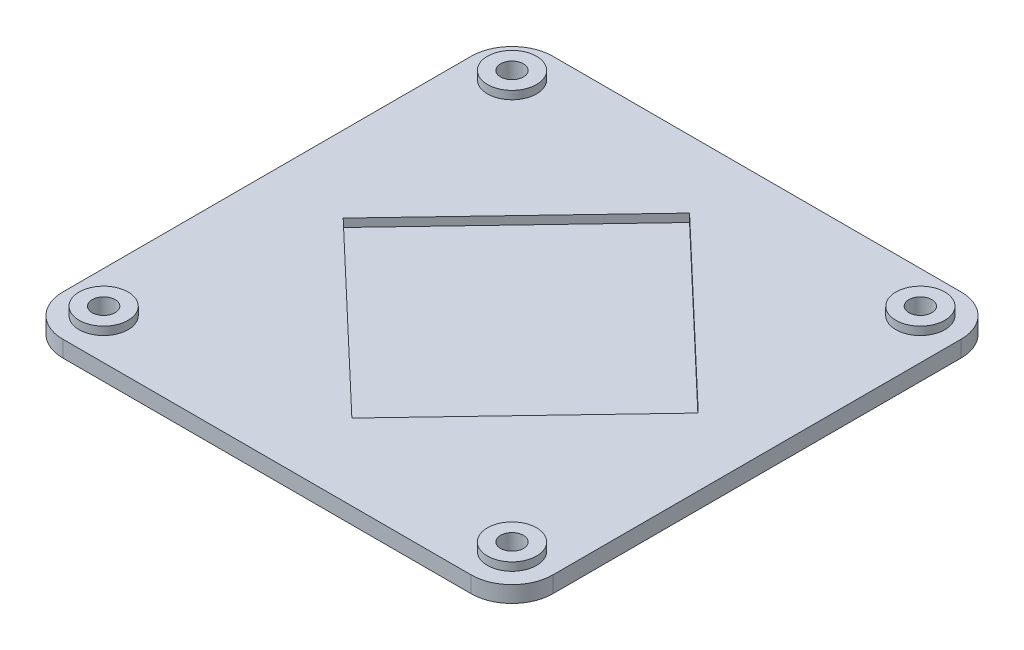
ISO-10303-21;
HEADER;
FILE_DESCRIPTION(('STEP AP214'),'2;1');
FILE_NAME('part.step','',(''),(''),'','','');
FILE_SCHEMA(('AUTOMOTIVE_DESIGN { 1 0 10303 214 1 1 1 1 }'));
ENDSEC;
DATA;
#1=APPLICATION_CONTEXT('core data for automotive mechanical design processes');
#2=APPLICATION_PROTOCOL_DEFINITION('international standard','automotive_design',2000,#1);
#3=PRODUCT_CONTEXT('',#1,'mechanical');
#4=PRODUCT('Part','Part','',(#3));
#5=PRODUCT_RELATED_PRODUCT_CATEGORY('part','',(#4));
#6=PRODUCT_DEFINITION_FORMATION('','',#4);
#7=PRODUCT_DEFINITION_CONTEXT('part definition',#1,'design');
#8=PRODUCT_DEFINITION('design','',#6,#7);
#9=PRODUCT_DEFINITION_SHAPE('','',#8);
#10=(LENGTH_UNIT() NAMED_UNIT(*) SI_UNIT(.MILLI.,.METRE.));
#11=(NAMED_UNIT(*) PLANE_ANGLE_UNIT() SI_UNIT($,.RADIAN.));
#12=(NAMED_UNIT(*) SI_UNIT($,.STERADIAN.) SOLID_ANGLE_UNIT());
#13=UNCERTAINTY_MEASURE_WITH_UNIT(LENGTH_MEASURE(1.E-05),#10,'distance_accuracy_value','');
#14=(GEOMETRIC_REPRESENTATION_CONTEXT(3) GLOBAL_UNCERTAINTY_ASSIGNED_CONTEXT((#13)) GLOBAL_UNIT_ASSIGNED_CONTEXT((#10,
#11,#12)) REPRESENTATION_CONTEXT('',''));
#15=CARTESIAN_POINT('',(0.,0.,0.));
#16=DIRECTION('',(0.,0.,1.));
#17=DIRECTION('',(1.,0.,0.));
#18=AXIS2_PLACEMENT_3D('',#15,#16,#17);
#19=CARTESIAN_POINT('',(30.,2.,-30.));
#20=DIRECTION('',(-1.,0.,0.));
#21=DIRECTION('',(0.,0.,1.));
#22=AXIS2_PLACEMENT_3D('',#19,#20,#21);
#23=PLANE('',#22);
#24=DIRECTION('',(0.,0.,-1.));
#25=VECTOR('',#24,1.);
#26=CARTESIAN_POINT('',(30.,0.,-30.));
#27=LINE('',#26,#25);
#28=CARTESIAN_POINT('',(30.,0.,25.));
#29=VERTEX_POINT('',#28);
#30=CARTESIAN_POINT('',(30.,0.,-25.));
#31=VERTEX_POINT('',#30);
#32=EDGE_CURVE('E212',#29,#31,#27,.T.);
#33=ORIENTED_EDGE('',*,*,#32,.T.);
#34=DIRECTION('',(0.,-1.,0.));
#35=VECTOR('',#34,1.);
#36=CARTESIAN_POINT('',(30.,2.,-25.));
#37=LINE('',#36,#35);
#38=CARTESIAN_POINT('',(30.,2.,-25.));
#39=VERTEX_POINT('',#38);
#40=EDGE_CURVE('E252',#31,#39,#37,.F.);
#41=ORIENTED_EDGE('',*,*,#40,.T.);
#42=DIRECTION('',(0.,0.,-1.));
#43=VECTOR('',#42,1.);
#44=CARTESIAN_POINT('',(30.,2.,-30.));
#45=LINE('',#44,#43);
#46=CARTESIAN_POINT('',(30.,2.,25.));
#47=VERTEX_POINT('',#46);
#48=EDGE_CURVE('E215',#47,#39,#45,.T.);
#49=ORIENTED_EDGE('',*,*,#48,.F.);
#50=DIRECTION('',(0.,-1.,0.));
#51=VECTOR('',#50,1.);
#52=CARTESIAN_POINT('',(30.,2.,25.));
#53=LINE('',#52,#51);
#54=EDGE_CURVE('E249',#47,#29,#53,.T.);
#55=ORIENTED_EDGE('',*,*,#54,.T.);
#56=EDGE_LOOP('',(#33,#41,#49,#55));
#57=FACE_BOUND('',#56,.T.);
#58=ADVANCED_FACE('F38',(#57),#23,.F.);
#59=CARTESIAN_POINT('',(-30.,2.,-30.));
#60=DIRECTION('',(0.,0.,1.));
#61=DIRECTION('',(1.,0.,0.));
#62=AXIS2_PLACEMENT_3D('',#59,#60,#61);
#63=PLANE('',#62);
#64=DIRECTION('',(-1.,0.,0.));
#65=VECTOR('',#64,1.);
#66=CARTESIAN_POINT('',(-30.,2.,-30.));
#67=LINE('',#66,#65);
#68=CARTESIAN_POINT('',(25.,2.,-30.));
#69=VERTEX_POINT('',#68);
#70=CARTESIAN_POINT('',(-25.,2.,-30.));
#71=VERTEX_POINT('',#70);
#72=EDGE_CURVE('E218',#69,#71,#67,.T.);
#73=ORIENTED_EDGE('',*,*,#72,.F.);
#74=DIRECTION('',(0.,-1.,0.));
#75=VECTOR('',#74,1.);
#76=CARTESIAN_POINT('',(25.,2.,-30.));
#77=LINE('',#76,#75);
#78=CARTESIAN_POINT('',(25.,0.,-30.));
#79=VERTEX_POINT('',#78);
#80=EDGE_CURVE('E238',#69,#79,#77,.T.);
#81=ORIENTED_EDGE('',*,*,#80,.T.);
#82=DIRECTION('',(-1.,0.,0.));
#83=VECTOR('',#82,1.);
#84=CARTESIAN_POINT('',(-30.,0.,-30.));
#85=LINE('',#84,#83);
#86=CARTESIAN_POINT('',(-25.,0.,-30.));
#87=VERTEX_POINT('',#86);
#88=EDGE_CURVE('E230',#79,#87,#85,.T.);
#89=ORIENTED_EDGE('',*,*,#88,.T.);
#90=DIRECTION('',(0.,-1.,0.));
#91=VECTOR('',#90,1.);
#92=CARTESIAN_POINT('',(-25.,2.,-30.));
#93=LINE('',#92,#91);
#94=EDGE_CURVE('E227',#87,#71,#93,.F.);
#95=ORIENTED_EDGE('',*,*,#94,.T.);
#96=EDGE_LOOP('',(#73,#81,#89,#95));
#97=FACE_BOUND('',#96,.T.);
#98=ADVANCED_FACE('F299',(#97),#63,.F.);
#99=CARTESIAN_POINT('',(-30.,2.,-30.));
#100=DIRECTION('',(1.,0.,0.));
#101=DIRECTION('',(0.,0.,-1.));
#102=AXIS2_PLACEMENT_3D('',#99,#100,#101);
#103=PLANE('',#102);
#104=DIRECTION('',(0.,0.,1.));
#105=VECTOR('',#104,1.);
#106=CARTESIAN_POINT('',(-30.,0.,-30.));
#107=LINE('',#106,#105);
#108=CARTESIAN_POINT('',(-30.,0.,-25.));
#109=VERTEX_POINT('',#108);
#110=CARTESIAN_POINT('',(-30.,0.,25.));
#111=VERTEX_POINT('',#110);
#112=EDGE_CURVE('E233',#109,#111,#107,.T.);
#113=ORIENTED_EDGE('',*,*,#112,.T.);
#114=DIRECTION('',(0.,-1.,0.));
#115=VECTOR('',#114,1.);
#116=CARTESIAN_POINT('',(-30.,2.,25.));
#117=LINE('',#116,#115);
#118=CARTESIAN_POINT('',(-30.,2.,25.));
#119=VERTEX_POINT('',#118);
#120=EDGE_CURVE('E11',#111,#119,#117,.F.);
#121=ORIENTED_EDGE('',*,*,#120,.T.);
#122=DIRECTION('',(0.,0.,1.));
#123=VECTOR('',#122,1.);
#124=CARTESIAN_POINT('',(-30.,2.,-30.));
#125=LINE('',#124,#123);
#126=CARTESIAN_POINT('',(-30.,2.,-25.));
#127=VERTEX_POINT('',#126);
#128=EDGE_CURVE('E222',#127,#119,#125,.T.);
#129=ORIENTED_EDGE('',*,*,#128,.F.);
#130=DIRECTION('',(0.,-1.,0.));
#131=VECTOR('',#130,1.);
#132=CARTESIAN_POINT('',(-30.,2.,-25.));
#133=LINE('',#132,#131);
#134=EDGE_CURVE('E46',#127,#109,#133,.T.);
#135=ORIENTED_EDGE('',*,*,#134,.T.);
#136=EDGE_LOOP('',(#113,#121,#129,#135));
#137=FACE_BOUND('',#136,.T.);
#138=ADVANCED_FACE('F270',(#137),#103,.F.);
#139=CARTESIAN_POINT('',(-30.,2.,30.));
#140=DIRECTION('',(0.,0.,-1.));
#141=DIRECTION('',(-1.,0.,0.));
#142=AXIS2_PLACEMENT_3D('',#139,#140,#141);
#143=PLANE('',#142);
#144=DIRECTION('',(1.,0.,0.));
#145=VECTOR('',#144,1.);
#146=CARTESIAN_POINT('',(-30.,0.,30.));
#147=LINE('',#146,#145);
#148=CARTESIAN_POINT('',(-25.,0.,30.));
#149=VERTEX_POINT('',#148);
#150=CARTESIAN_POINT('',(25.,0.,30.));
#151=VERTEX_POINT('',#150);
#152=EDGE_CURVE('E219',#149,#151,#147,.T.);
#153=ORIENTED_EDGE('',*,*,#152,.T.);
#154=DIRECTION('',(0.,-1.,0.));
#155=VECTOR('',#154,1.);
#156=CARTESIAN_POINT('',(25.,2.,30.));
#157=LINE('',#156,#155);
#158=CARTESIAN_POINT('',(25.,2.,30.));
#159=VERTEX_POINT('',#158);
#160=EDGE_CURVE('E61',#151,#159,#157,.F.);
#161=ORIENTED_EDGE('',*,*,#160,.T.);
#162=DIRECTION('',(1.,0.,0.));
#163=VECTOR('',#162,1.);
#164=CARTESIAN_POINT('',(-30.,2.,30.));
#165=LINE('',#164,#163);
#166=CARTESIAN_POINT('',(-25.,2.,30.));
#167=VERTEX_POINT('',#166);
#168=EDGE_CURVE('E225',#167,#159,#165,.T.);
#169=ORIENTED_EDGE('',*,*,#168,.F.);
#170=DIRECTION('',(0.,-1.,0.));
#171=VECTOR('',#170,1.);
#172=CARTESIAN_POINT('',(-25.,2.,30.));
#173=LINE('',#172,#171);
#174=EDGE_CURVE('E262',#167,#149,#173,.T.);
#175=ORIENTED_EDGE('',*,*,#174,.T.);
#176=EDGE_LOOP('',(#153,#161,#169,#175));
#177=FACE_BOUND('',#176,.T.);
#178=ADVANCED_FACE('F282',(#177),#143,.F.);
#179=CARTESIAN_POINT('',(0.,2.,0.));
#180=DIRECTION('',(0.,1.,0.));
#181=DIRECTION('',(0.,0.,1.));
#182=AXIS2_PLACEMENT_3D('',#179,#180,#181);
#183=PLANE('',#182);
#184=DIRECTION('',(-0.689120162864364,0.,0.724647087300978));
#185=VECTOR('',#184,1.);
#186=CARTESIAN_POINT('',(-20.6736048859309,2.,0.));
#187=LINE('',#186,#185);
#188=CARTESIAN_POINT('',(0.,2.,-21.7394126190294));
#189=VERTEX_POINT('',#188);
#190=CARTESIAN_POINT('',(-20.6736048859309,2.,0.));
#191=VERTEX_POINT('',#190);
#192=EDGE_CURVE('E53',#189,#191,#187,.T.);
#193=ORIENTED_EDGE('',*,*,#192,.F.);
#194=DIRECTION('',(-0.724647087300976,0.,-0.689120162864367));
#195=VECTOR('',#194,1.);
#196=CARTESIAN_POINT('',(0.,2.,-21.7394126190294));
#197=LINE('',#196,#195);
#198=CARTESIAN_POINT('',(21.7394126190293,2.,-1.06580773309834));
#199=VERTEX_POINT('',#198);
#200=EDGE_CURVE('E148',#199,#189,#197,.T.);
#201=ORIENTED_EDGE('',*,*,#200,.F.);
#202=DIRECTION('',(0.689120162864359,0.,-0.724647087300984));
#203=VECTOR('',#202,1.);
#204=CARTESIAN_POINT('',(21.7394126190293,2.,-1.06580773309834));
#205=LINE('',#204,#203);
#206=CARTESIAN_POINT('',(1.06580773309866,2.,20.673604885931));
#207=VERTEX_POINT('',#206);
#208=EDGE_CURVE('E151',#207,#199,#205,.T.);
#209=ORIENTED_EDGE('',*,*,#208,.F.);
#210=DIRECTION('',(0.724647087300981,0.,0.689120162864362));
#211=VECTOR('',#210,1.);
#212=CARTESIAN_POINT('',(1.06580773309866,2.,20.673604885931));
#213=LINE('',#212,#211);
#214=EDGE_CURVE('E157',#191,#207,#213,.T.);
#215=ORIENTED_EDGE('',*,*,#214,.F.);
#216=EDGE_LOOP('',(#193,#201,#209,#215));
#217=FACE_BOUND('',#216,.T.);
#218=CARTESIAN_POINT('',(-24.9999999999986,2.,25.));
#219=DIRECTION('',(0.,1.,0.));
#220=DIRECTION('',(0.,0.,1.));
#221=AXIS2_PLACEMENT_3D('',#218,#219,#220);
#222=CIRCLE('',#221,3.00000000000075);
#223=CARTESIAN_POINT('',(-24.9999999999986,2.,28.0000000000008));
#224=VERTEX_POINT('',#223);
#225=EDGE_CURVE('E190',#224,#224,#222,.T.);
#226=ORIENTED_EDGE('',*,*,#225,.F.);
#227=EDGE_LOOP('',(#226));
#228=FACE_BOUND('',#227,.T.);
#229=CARTESIAN_POINT('',(25.0000000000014,2.,24.9999999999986));
#230=DIRECTION('',(0.,1.,0.));
#231=DIRECTION('',(0.,0.,1.));
#232=AXIS2_PLACEMENT_3D('',#229,#230,#231);
#233=CIRCLE('',#232,3.00000000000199);
#234=CARTESIAN_POINT('',(25.0000000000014,2.,28.0000000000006));
#235=VERTEX_POINT('',#234);
#236=EDGE_CURVE('E194',#235,#235,#233,.T.);
#237=ORIENTED_EDGE('',*,*,#236,.F.);
#238=EDGE_LOOP('',(#237));
#239=FACE_BOUND('',#238,.T.);
#240=CARTESIAN_POINT('',(25.,2.,-25.0000000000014));
#241=DIRECTION('',(0.,1.,0.));
#242=DIRECTION('',(0.,0.,1.));
#243=AXIS2_PLACEMENT_3D('',#240,#241,#242);
#244=CIRCLE('',#243,3.00000000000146);
#245=CARTESIAN_POINT('',(25.,2.,-22.));
#246=VERTEX_POINT('',#245);
#247=EDGE_CURVE('E200',#246,#246,#244,.T.);
#248=ORIENTED_EDGE('',*,*,#247,.F.);
#249=EDGE_LOOP('',(#248));
#250=FACE_BOUND('',#249,.T.);
#251=CARTESIAN_POINT('',(-25.,2.,-25.));
#252=DIRECTION('',(0.,1.,0.));
#253=DIRECTION('',(0.,0.,1.));
#254=AXIS2_PLACEMENT_3D('',#251,#252,#253);
#255=CIRCLE('',#254,3.);
#256=CARTESIAN_POINT('',(-25.,2.,-22.));
#257=VERTEX_POINT('',#256);
#258=EDGE_CURVE('E206',#257,#257,#255,.T.);
#259=ORIENTED_EDGE('',*,*,#258,.F.);
#260=EDGE_LOOP('',(#259));
#261=FACE_BOUND('',#260,.T.);
#262=ORIENTED_EDGE('',*,*,#48,.T.);
#263=CARTESIAN_POINT('',(25.,2.,-25.));
#264=DIRECTION('',(0.,1.,0.));
#265=DIRECTION('',(0.,0.,1.));
#266=AXIS2_PLACEMENT_3D('',#263,#264,#265);
#267=CIRCLE('',#266,5.);
#268=EDGE_CURVE('E260',#39,#69,#267,.T.);
#269=ORIENTED_EDGE('',*,*,#268,.T.);
#270=ORIENTED_EDGE('',*,*,#72,.T.);
#271=CARTESIAN_POINT('',(-25.,2.,-25.));
#272=DIRECTION('',(0.,1.,0.));
#273=DIRECTION('',(0.,0.,1.));
#274=AXIS2_PLACEMENT_3D('',#271,#272,#273);
#275=CIRCLE('',#274,5.);
#276=EDGE_CURVE('E254',#71,#127,#275,.T.);
#277=ORIENTED_EDGE('',*,*,#276,.T.);
#278=ORIENTED_EDGE('',*,*,#128,.T.);
#279=CARTESIAN_POINT('',(-25.,2.,25.));
#280=DIRECTION('',(0.,1.,0.));
#281=DIRECTION('',(0.,0.,1.));
#282=AXIS2_PLACEMENT_3D('',#279,#280,#281);
#283=CIRCLE('',#282,5.);
#284=EDGE_CURVE('E256',#119,#167,#283,.T.);
#285=ORIENTED_EDGE('',*,*,#284,.T.);
#286=ORIENTED_EDGE('',*,*,#168,.T.);
#287=CARTESIAN_POINT('',(25.,2.,25.));
#288=DIRECTION('',(0.,1.,0.));
#289=DIRECTION('',(0.,0.,1.));
#290=AXIS2_PLACEMENT_3D('',#287,#288,#289);
#291=CIRCLE('',#290,5.);
#292=EDGE_CURVE('E258',#159,#47,#291,.T.);
#293=ORIENTED_EDGE('',*,*,#292,.T.);
#294=EDGE_LOOP('',(#262,#269,#270,#277,#278,#285,#286,#293));
#295=FACE_BOUND('',#294,.T.);
#296=ADVANCED_FACE('F285',(#217,#228,#239,#250,#261,#295),#183,.T.);
#297=CARTESIAN_POINT('',(0.,0.,0.));
#298=DIRECTION('',(0.,1.,0.));
#299=DIRECTION('',(0.,0.,1.));
#300=AXIS2_PLACEMENT_3D('',#297,#298,#299);
#301=PLANE('',#300);
#302=CARTESIAN_POINT('',(-24.9999999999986,0.,25.));
#303=DIRECTION('',(0.,1.,0.));
#304=DIRECTION('',(0.,0.,1.));
#305=AXIS2_PLACEMENT_3D('',#302,#303,#304);
#306=CIRCLE('',#305,1.4);
#307=CARTESIAN_POINT('',(-24.9999999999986,0.,26.4));
#308=VERTEX_POINT('',#307);
#309=EDGE_CURVE('E178',#308,#308,#306,.T.);
#310=ORIENTED_EDGE('',*,*,#309,.T.);
#311=EDGE_LOOP('',(#310));
#312=FACE_BOUND('',#311,.T.);
#313=CARTESIAN_POINT('',(25.0000000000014,0.,24.9999999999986));
#314=DIRECTION('',(0.,1.,0.));
#315=DIRECTION('',(0.,0.,1.));
#316=AXIS2_PLACEMENT_3D('',#313,#314,#315);
#317=CIRCLE('',#316,1.4);
#318=CARTESIAN_POINT('',(25.0000000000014,0.,26.3999999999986));
#319=VERTEX_POINT('',#318);
#320=EDGE_CURVE('E181',#319,#319,#317,.T.);
#321=ORIENTED_EDGE('',*,*,#320,.T.);
#322=EDGE_LOOP('',(#321));
#323=FACE_BOUND('',#322,.T.);
#324=CARTESIAN_POINT('',(25.,0.,-25.0000000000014));
#325=DIRECTION('',(0.,1.,0.));
#326=DIRECTION('',(0.,0.,1.));
#327=AXIS2_PLACEMENT_3D('',#324,#325,#326);
#328=CIRCLE('',#327,1.4);
#329=CARTESIAN_POINT('',(25.,0.,-23.6000000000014));
#330=VERTEX_POINT('',#329);
#331=EDGE_CURVE('E184',#330,#330,#328,.T.);
#332=ORIENTED_EDGE('',*,*,#331,.T.);
#333=EDGE_LOOP('',(#332));
#334=FACE_BOUND('',#333,.T.);
#335=CARTESIAN_POINT('',(-25.,0.,-25.));
#336=DIRECTION('',(0.,1.,0.));
#337=DIRECTION('',(0.,0.,1.));
#338=AXIS2_PLACEMENT_3D('',#335,#336,#337);
#339=CIRCLE('',#338,1.4);
#340=CARTESIAN_POINT('',(-25.,0.,-23.6));
#341=VERTEX_POINT('',#340);
#342=EDGE_CURVE('E187',#341,#341,#339,.T.);
#343=ORIENTED_EDGE('',*,*,#342,.T.);
#344=EDGE_LOOP('',(#343));
#345=FACE_BOUND('',#344,.T.);
#346=ORIENTED_EDGE('',*,*,#88,.F.);
#347=CARTESIAN_POINT('',(25.,0.,-25.));
#348=DIRECTION('',(0.,1.,0.));
#349=DIRECTION('',(0.,0.,1.));
#350=AXIS2_PLACEMENT_3D('',#347,#348,#349);
#351=CIRCLE('',#350,5.);
#352=EDGE_CURVE('E247',#79,#31,#351,.F.);
#353=ORIENTED_EDGE('',*,*,#352,.T.);
#354=ORIENTED_EDGE('',*,*,#32,.F.);
#355=CARTESIAN_POINT('',(25.,0.,25.));
#356=DIRECTION('',(0.,1.,0.));
#357=DIRECTION('',(0.,0.,1.));
#358=AXIS2_PLACEMENT_3D('',#355,#356,#357);
#359=CIRCLE('',#358,5.);
#360=EDGE_CURVE('E245',#29,#151,#359,.F.);
#361=ORIENTED_EDGE('',*,*,#360,.T.);
#362=ORIENTED_EDGE('',*,*,#152,.F.);
#363=CARTESIAN_POINT('',(-25.,0.,25.));
#364=DIRECTION('',(0.,1.,0.));
#365=DIRECTION('',(0.,0.,1.));
#366=AXIS2_PLACEMENT_3D('',#363,#364,#365);
#367=CIRCLE('',#366,5.);
#368=EDGE_CURVE('E243',#149,#111,#367,.F.);
#369=ORIENTED_EDGE('',*,*,#368,.T.);
#370=ORIENTED_EDGE('',*,*,#112,.F.);
#371=CARTESIAN_POINT('',(-25.,0.,-25.));
#372=DIRECTION('',(0.,1.,0.));
#373=DIRECTION('',(0.,0.,1.));
#374=AXIS2_PLACEMENT_3D('',#371,#372,#373);
#375=CIRCLE('',#374,5.);
#376=EDGE_CURVE('E241',#109,#87,#375,.F.);
#377=ORIENTED_EDGE('',*,*,#376,.T.);
#378=EDGE_LOOP('',(#346,#353,#354,#361,#362,#369,#370,#377));
#379=FACE_BOUND('',#378,.T.);
#380=ADVANCED_FACE('F276',(#312,#323,#334,#345,#379),#301,.F.);
#381=CARTESIAN_POINT('',(25.,2.,-25.));
#382=DIRECTION('',(0.,-1.,0.));
#383=DIRECTION('',(0.,0.,-1.));
#384=AXIS2_PLACEMENT_3D('',#381,#382,#383);
#385=CYLINDRICAL_SURFACE('',#384,5.);
#386=ORIENTED_EDGE('',*,*,#268,.F.);
#387=ORIENTED_EDGE('',*,*,#40,.F.);
#388=ORIENTED_EDGE('',*,*,#352,.F.);
#389=ORIENTED_EDGE('',*,*,#80,.F.);
#390=EDGE_LOOP('',(#386,#387,#388,#389));
#391=FACE_BOUND('',#390,.T.);
#392=ADVANCED_FACE('F296',(#391),#385,.T.);
#393=CARTESIAN_POINT('',(25.,2.,25.));
#394=DIRECTION('',(0.,-1.,0.));
#395=DIRECTION('',(0.,0.,-1.));
#396=AXIS2_PLACEMENT_3D('',#393,#394,#395);
#397=CYLINDRICAL_SURFACE('',#396,5.);
#398=ORIENTED_EDGE('',*,*,#292,.F.);
#399=ORIENTED_EDGE('',*,*,#160,.F.);
#400=ORIENTED_EDGE('',*,*,#360,.F.);
#401=ORIENTED_EDGE('',*,*,#54,.F.);
#402=EDGE_LOOP('',(#398,#399,#400,#401));
#403=FACE_BOUND('',#402,.T.);
#404=ADVANCED_FACE('F289',(#403),#397,.T.);
#405=CARTESIAN_POINT('',(-25.,2.,25.));
#406=DIRECTION('',(0.,-1.,0.));
#407=DIRECTION('',(0.,0.,-1.));
#408=AXIS2_PLACEMENT_3D('',#405,#406,#407);
#409=CYLINDRICAL_SURFACE('',#408,5.);
#410=ORIENTED_EDGE('',*,*,#284,.F.);
#411=ORIENTED_EDGE('',*,*,#120,.F.);
#412=ORIENTED_EDGE('',*,*,#368,.F.);
#413=ORIENTED_EDGE('',*,*,#174,.F.);
#414=EDGE_LOOP('',(#410,#411,#412,#413));
#415=FACE_BOUND('',#414,.T.);
#416=ADVANCED_FACE('F281',(#415),#409,.T.);
#417=CARTESIAN_POINT('',(-25.,2.,-25.));
#418=DIRECTION('',(0.,-1.,0.));
#419=DIRECTION('',(0.,0.,-1.));
#420=AXIS2_PLACEMENT_3D('',#417,#418,#419);
#421=CYLINDRICAL_SURFACE('',#420,5.);
#422=ORIENTED_EDGE('',*,*,#276,.F.);
#423=ORIENTED_EDGE('',*,*,#94,.F.);
#424=ORIENTED_EDGE('',*,*,#376,.F.);
#425=ORIENTED_EDGE('',*,*,#134,.F.);
#426=EDGE_LOOP('',(#422,#423,#424,#425));
#427=FACE_BOUND('',#426,.T.);
#428=ADVANCED_FACE('F40',(#427),#421,.T.);
#429=CARTESIAN_POINT('',(-25.,3.,-25.));
#430=DIRECTION('',(0.,-1.,0.));
#431=DIRECTION('',(0.,0.,-1.));
#432=AXIS2_PLACEMENT_3D('',#429,#430,#431);
#433=CYLINDRICAL_SURFACE('',#432,3.);
#434=CARTESIAN_POINT('',(-25.,3.,-25.));
#435=DIRECTION('',(0.,1.,0.));
#436=DIRECTION('',(0.,0.,1.));
#437=AXIS2_PLACEMENT_3D('',#434,#435,#436);
#438=CIRCLE('',#437,3.);
#439=CARTESIAN_POINT('',(-25.,3.,-22.));
#440=VERTEX_POINT('',#439);
#441=EDGE_CURVE('E209',#440,#440,#438,.T.);
#442=ORIENTED_EDGE('',*,*,#441,.F.);
#443=EDGE_LOOP('',(#442));
#444=FACE_BOUND('',#443,.T.);
#445=ORIENTED_EDGE('',*,*,#258,.T.);
#446=EDGE_LOOP('',(#445));
#447=FACE_BOUND('',#446,.T.);
#448=ADVANCED_FACE('F302',(#444,#447),#433,.T.);
#449=CARTESIAN_POINT('',(-25.,3.,-25.));
#450=DIRECTION('',(0.,1.,0.));
#451=DIRECTION('',(0.,0.,1.));
#452=AXIS2_PLACEMENT_3D('',#449,#450,#451);
#453=PLANE('',#452);
#454=CARTESIAN_POINT('',(-25.,3.,-25.));
#455=DIRECTION('',(0.,1.,0.));
#456=DIRECTION('',(0.,0.,1.));
#457=AXIS2_PLACEMENT_3D('',#454,#455,#456);
#458=CIRCLE('',#457,1.4);
#459=CARTESIAN_POINT('',(-25.,3.,-23.6));
#460=VERTEX_POINT('',#459);
#461=EDGE_CURVE('E170',#460,#460,#458,.T.);
#462=ORIENTED_EDGE('',*,*,#461,.F.);
#463=EDGE_LOOP('',(#462));
#464=FACE_BOUND('',#463,.T.);
#465=ORIENTED_EDGE('',*,*,#441,.T.);
#466=EDGE_LOOP('',(#465));
#467=FACE_BOUND('',#466,.T.);
#468=ADVANCED_FACE('F307',(#464,#467),#453,.T.);
#469=CARTESIAN_POINT('',(25.,3.,-25.0000000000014));
#470=DIRECTION('',(0.,-1.,0.));
#471=DIRECTION('',(0.,0.,-1.));
#472=AXIS2_PLACEMENT_3D('',#469,#470,#471);
#473=CYLINDRICAL_SURFACE('',#472,3.00000000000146);
#474=CARTESIAN_POINT('',(25.,3.,-25.0000000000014));
#475=DIRECTION('',(0.,1.,0.));
#476=DIRECTION('',(0.,0.,1.));
#477=AXIS2_PLACEMENT_3D('',#474,#475,#476);
#478=CIRCLE('',#477,3.00000000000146);
#479=CARTESIAN_POINT('',(25.,3.,-22.));
#480=VERTEX_POINT('',#479);
#481=EDGE_CURVE('E203',#480,#480,#478,.T.);
#482=ORIENTED_EDGE('',*,*,#481,.F.);
#483=EDGE_LOOP('',(#482));
#484=FACE_BOUND('',#483,.T.);
#485=ORIENTED_EDGE('',*,*,#247,.T.);
#486=EDGE_LOOP('',(#485));
#487=FACE_BOUND('',#486,.T.);
#488=ADVANCED_FACE('F347',(#484,#487),#473,.T.);
#489=CARTESIAN_POINT('',(25.,3.,-25.0000000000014));
#490=DIRECTION('',(0.,1.,0.));
#491=DIRECTION('',(0.,0.,1.));
#492=AXIS2_PLACEMENT_3D('',#489,#490,#491);
#493=PLANE('',#492);
#494=CARTESIAN_POINT('',(25.,3.,-25.0000000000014));
#495=DIRECTION('',(0.,1.,0.));
#496=DIRECTION('',(0.,0.,1.));
#497=AXIS2_PLACEMENT_3D('',#494,#495,#496);
#498=CIRCLE('',#497,1.4);
#499=CARTESIAN_POINT('',(25.,3.,-23.6000000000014));
#500=VERTEX_POINT('',#499);
#501=EDGE_CURVE('E167',#500,#500,#498,.T.);
#502=ORIENTED_EDGE('',*,*,#501,.F.);
#503=EDGE_LOOP('',(#502));
#504=FACE_BOUND('',#503,.T.);
#505=ORIENTED_EDGE('',*,*,#481,.T.);
#506=EDGE_LOOP('',(#505));
#507=FACE_BOUND('',#506,.T.);
#508=ADVANCED_FACE('F352',(#504,#507),#493,.T.);
#509=CARTESIAN_POINT('',(25.0000000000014,3.,24.9999999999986));
#510=DIRECTION('',(0.,-1.,0.));
#511=DIRECTION('',(0.,0.,-1.));
#512=AXIS2_PLACEMENT_3D('',#509,#510,#511);
#513=CYLINDRICAL_SURFACE('',#512,3.00000000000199);
#514=CARTESIAN_POINT('',(25.0000000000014,3.,24.9999999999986));
#515=DIRECTION('',(0.,1.,0.));
#516=DIRECTION('',(0.,0.,1.));
#517=AXIS2_PLACEMENT_3D('',#514,#515,#516);
#518=CIRCLE('',#517,3.00000000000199);
#519=CARTESIAN_POINT('',(25.0000000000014,3.,28.0000000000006));
#520=VERTEX_POINT('',#519);
#521=EDGE_CURVE('E197',#520,#520,#518,.T.);
#522=ORIENTED_EDGE('',*,*,#521,.F.);
#523=EDGE_LOOP('',(#522));
#524=FACE_BOUND('',#523,.T.);
#525=ORIENTED_EDGE('',*,*,#236,.T.);
#526=EDGE_LOOP('',(#525));
#527=FACE_BOUND('',#526,.T.);
#528=ADVANCED_FACE('F360',(#524,#527),#513,.T.);
#529=CARTESIAN_POINT('',(25.0000000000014,3.,24.9999999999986));
#530=DIRECTION('',(0.,1.,0.));
#531=DIRECTION('',(0.,0.,1.));
#532=AXIS2_PLACEMENT_3D('',#529,#530,#531);
#533=PLANE('',#532);
#534=CARTESIAN_POINT('',(25.0000000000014,3.,24.9999999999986));
#535=DIRECTION('',(0.,1.,0.));
#536=DIRECTION('',(0.,0.,1.));
#537=AXIS2_PLACEMENT_3D('',#534,#535,#536);
#538=CIRCLE('',#537,1.4);
#539=CARTESIAN_POINT('',(25.0000000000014,3.,26.3999999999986));
#540=VERTEX_POINT('',#539);
#541=EDGE_CURVE('E171',#540,#540,#538,.T.);
#542=ORIENTED_EDGE('',*,*,#541,.F.);
#543=EDGE_LOOP('',(#542));
#544=FACE_BOUND('',#543,.T.);
#545=ORIENTED_EDGE('',*,*,#521,.T.);
#546=EDGE_LOOP('',(#545));
#547=FACE_BOUND('',#546,.T.);
#548=ADVANCED_FACE('F365',(#544,#547),#533,.T.);
#549=CARTESIAN_POINT('',(-24.9999999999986,3.,25.));
#550=DIRECTION('',(0.,-1.,0.));
#551=DIRECTION('',(0.,0.,-1.));
#552=AXIS2_PLACEMENT_3D('',#549,#550,#551);
#553=CYLINDRICAL_SURFACE('',#552,3.00000000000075);
#554=CARTESIAN_POINT('',(-24.9999999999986,3.,25.));
#555=DIRECTION('',(0.,1.,0.));
#556=DIRECTION('',(0.,0.,1.));
#557=AXIS2_PLACEMENT_3D('',#554,#555,#556);
#558=CIRCLE('',#557,3.00000000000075);
#559=CARTESIAN_POINT('',(-24.9999999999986,3.,28.0000000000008));
#560=VERTEX_POINT('',#559);
#561=EDGE_CURVE('E191',#560,#560,#558,.T.);
#562=ORIENTED_EDGE('',*,*,#561,.F.);
#563=EDGE_LOOP('',(#562));
#564=FACE_BOUND('',#563,.T.);
#565=ORIENTED_EDGE('',*,*,#225,.T.);
#566=EDGE_LOOP('',(#565));
#567=FACE_BOUND('',#566,.T.);
#568=ADVANCED_FACE('F373',(#564,#567),#553,.T.);
#569=CARTESIAN_POINT('',(-24.9999999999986,3.,25.));
#570=DIRECTION('',(0.,1.,0.));
#571=DIRECTION('',(0.,0.,1.));
#572=AXIS2_PLACEMENT_3D('',#569,#570,#571);
#573=PLANE('',#572);
#574=CARTESIAN_POINT('',(-24.9999999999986,3.,25.));
#575=DIRECTION('',(0.,1.,0.));
#576=DIRECTION('',(0.,0.,1.));
#577=AXIS2_PLACEMENT_3D('',#574,#575,#576);
#578=CIRCLE('',#577,1.4);
#579=CARTESIAN_POINT('',(-24.9999999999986,3.,26.4));
#580=VERTEX_POINT('',#579);
#581=EDGE_CURVE('E163',#580,#580,#578,.T.);
#582=ORIENTED_EDGE('',*,*,#581,.F.);
#583=EDGE_LOOP('',(#582));
#584=FACE_BOUND('',#583,.T.);
#585=ORIENTED_EDGE('',*,*,#561,.T.);
#586=EDGE_LOOP('',(#585));
#587=FACE_BOUND('',#586,.T.);
#588=ADVANCED_FACE('F378',(#584,#587),#573,.T.);
#589=CARTESIAN_POINT('',(-24.9999999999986,-3.,25.));
#590=DIRECTION('',(0.,1.,0.));
#591=DIRECTION('',(0.,0.,1.));
#592=AXIS2_PLACEMENT_3D('',#589,#590,#591);
#593=CYLINDRICAL_SURFACE('',#592,1.4);
#594=ORIENTED_EDGE('',*,*,#581,.T.);
#595=EDGE_LOOP('',(#594));
#596=FACE_BOUND('',#595,.T.);
#597=ORIENTED_EDGE('',*,*,#309,.F.);
#598=EDGE_LOOP('',(#597));
#599=FACE_BOUND('',#598,.T.);
#600=ADVANCED_FACE('F420',(#596,#599),#593,.F.);
#601=CARTESIAN_POINT('',(25.0000000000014,-3.,24.9999999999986));
#602=DIRECTION('',(0.,1.,0.));
#603=DIRECTION('',(0.,0.,1.));
#604=AXIS2_PLACEMENT_3D('',#601,#602,#603);
#605=CYLINDRICAL_SURFACE('',#604,1.4);
#606=ORIENTED_EDGE('',*,*,#541,.T.);
#607=EDGE_LOOP('',(#606));
#608=FACE_BOUND('',#607,.T.);
#609=ORIENTED_EDGE('',*,*,#320,.F.);
#610=EDGE_LOOP('',(#609));
#611=FACE_BOUND('',#610,.T.);
#612=ADVANCED_FACE('F430',(#608,#611),#605,.F.);
#613=CARTESIAN_POINT('',(25.,-3.,-25.0000000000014));
#614=DIRECTION('',(0.,1.,0.));
#615=DIRECTION('',(0.,0.,1.));
#616=AXIS2_PLACEMENT_3D('',#613,#614,#615);
#617=CYLINDRICAL_SURFACE('',#616,1.4);
#618=ORIENTED_EDGE('',*,*,#501,.T.);
#619=EDGE_LOOP('',(#618));
#620=FACE_BOUND('',#619,.T.);
#621=ORIENTED_EDGE('',*,*,#331,.F.);
#622=EDGE_LOOP('',(#621));
#623=FACE_BOUND('',#622,.T.);
#624=ADVANCED_FACE('F440',(#620,#623),#617,.F.);
#625=CARTESIAN_POINT('',(-25.,-3.,-25.));
#626=DIRECTION('',(0.,1.,0.));
#627=DIRECTION('',(0.,0.,1.));
#628=AXIS2_PLACEMENT_3D('',#625,#626,#627);
#629=CYLINDRICAL_SURFACE('',#628,1.4);
#630=ORIENTED_EDGE('',*,*,#461,.T.);
#631=EDGE_LOOP('',(#630));
#632=FACE_BOUND('',#631,.T.);
#633=ORIENTED_EDGE('',*,*,#342,.F.);
#634=EDGE_LOOP('',(#633));
#635=FACE_BOUND('',#634,.T.);
#636=ADVANCED_FACE('F450',(#632,#635),#629,.F.);
#637=CARTESIAN_POINT('',(-20.6736048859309,1.,0.));
#638=DIRECTION('',(-0.724647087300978,0.,-0.689120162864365));
#639=DIRECTION('',(-0.689120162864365,0.,0.724647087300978));
#640=AXIS2_PLACEMENT_3D('',#637,#638,#639);
#641=PLANE('',#640);
#642=ORIENTED_EDGE('',*,*,#192,.T.);
#643=DIRECTION('',(0.,1.,0.));
#644=VECTOR('',#643,1.);
#645=CARTESIAN_POINT('',(-20.6736048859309,1.,0.));
#646=LINE('',#645,#644);
#647=CARTESIAN_POINT('',(-20.6736048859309,1.,0.));
#648=VERTEX_POINT('',#647);
#649=EDGE_CURVE('E126',#648,#191,#646,.T.);
#650=ORIENTED_EDGE('',*,*,#649,.F.);
#651=DIRECTION('',(-0.689120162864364,0.,0.724647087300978));
#652=VECTOR('',#651,1.);
#653=CARTESIAN_POINT('',(-20.6736048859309,1.,0.));
#654=LINE('',#653,#652);
#655=CARTESIAN_POINT('',(0.,1.,-21.7394126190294));
#656=VERTEX_POINT('',#655);
#657=EDGE_CURVE('E130',#656,#648,#654,.T.);
#658=ORIENTED_EDGE('',*,*,#657,.F.);
#659=DIRECTION('',(0.,1.,0.));
#660=VECTOR('',#659,1.);
#661=CARTESIAN_POINT('',(0.,1.,-21.7394126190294));
#662=LINE('',#661,#660);
#663=EDGE_CURVE('E161',#656,#189,#662,.T.);
#664=ORIENTED_EDGE('',*,*,#663,.T.);
#665=EDGE_LOOP('',(#642,#650,#658,#664));
#666=FACE_BOUND('',#665,.T.);
#667=ADVANCED_FACE('F128',(#666),#641,.F.);
#668=CARTESIAN_POINT('',(0.,1.,-21.7394126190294));
#669=DIRECTION('',(0.689120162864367,0.,-0.724647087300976));
#670=DIRECTION('',(-0.724647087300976,0.,-0.689120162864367));
#671=AXIS2_PLACEMENT_3D('',#668,#669,#670);
#672=PLANE('',#671);
#673=ORIENTED_EDGE('',*,*,#200,.T.);
#674=ORIENTED_EDGE('',*,*,#663,.F.);
#675=DIRECTION('',(-0.724647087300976,0.,-0.689120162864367));
#676=VECTOR('',#675,1.);
#677=CARTESIAN_POINT('',(0.,1.,-21.7394126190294));
#678=LINE('',#677,#676);
#679=CARTESIAN_POINT('',(21.7394126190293,1.,-1.06580773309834));
#680=VERTEX_POINT('',#679);
#681=EDGE_CURVE('E136',#680,#656,#678,.T.);
#682=ORIENTED_EDGE('',*,*,#681,.F.);
#683=DIRECTION('',(0.,1.,0.));
#684=VECTOR('',#683,1.);
#685=CARTESIAN_POINT('',(21.7394126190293,1.,-1.06580773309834));
#686=LINE('',#685,#684);
#687=EDGE_CURVE('E164',#680,#199,#686,.T.);
#688=ORIENTED_EDGE('',*,*,#687,.T.);
#689=EDGE_LOOP('',(#673,#674,#682,#688));
#690=FACE_BOUND('',#689,.T.);
#691=ADVANCED_FACE('F478',(#690),#672,.F.);
#692=CARTESIAN_POINT('',(21.7394126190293,1.,-1.06580773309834));
#693=DIRECTION('',(0.724647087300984,0.,0.689120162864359));
#694=DIRECTION('',(0.689120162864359,0.,-0.724647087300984));
#695=AXIS2_PLACEMENT_3D('',#692,#693,#694);
#696=PLANE('',#695);
#697=ORIENTED_EDGE('',*,*,#208,.T.);
#698=ORIENTED_EDGE('',*,*,#687,.F.);
#699=DIRECTION('',(0.689120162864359,0.,-0.724647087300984));
#700=VECTOR('',#699,1.);
#701=CARTESIAN_POINT('',(21.7394126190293,1.,-1.06580773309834));
#702=LINE('',#701,#700);
#703=CARTESIAN_POINT('',(1.06580773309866,1.,20.673604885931));
#704=VERTEX_POINT('',#703);
#705=EDGE_CURVE('E144',#704,#680,#702,.T.);
#706=ORIENTED_EDGE('',*,*,#705,.F.);
#707=DIRECTION('',(0.,1.,0.));
#708=VECTOR('',#707,1.);
#709=CARTESIAN_POINT('',(1.06580773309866,1.,20.673604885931));
#710=LINE('',#709,#708);
#711=EDGE_CURVE('E135',#704,#207,#710,.T.);
#712=ORIENTED_EDGE('',*,*,#711,.T.);
#713=EDGE_LOOP('',(#697,#698,#706,#712));
#714=FACE_BOUND('',#713,.T.);
#715=ADVANCED_FACE('F487',(#714),#696,.F.);
#716=CARTESIAN_POINT('',(1.06580773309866,1.,20.673604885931));
#717=DIRECTION('',(-0.689120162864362,0.,0.724647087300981));
#718=DIRECTION('',(0.724647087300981,0.,0.689120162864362));
#719=AXIS2_PLACEMENT_3D('',#716,#717,#718);
#720=PLANE('',#719);
#721=ORIENTED_EDGE('',*,*,#214,.T.);
#722=ORIENTED_EDGE('',*,*,#711,.F.);
#723=DIRECTION('',(0.724647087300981,0.,0.689120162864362));
#724=VECTOR('',#723,1.);
#725=CARTESIAN_POINT('',(1.06580773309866,1.,20.673604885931));
#726=LINE('',#725,#724);
#727=EDGE_CURVE('E139',#648,#704,#726,.T.);
#728=ORIENTED_EDGE('',*,*,#727,.F.);
#729=ORIENTED_EDGE('',*,*,#649,.T.);
#730=EDGE_LOOP('',(#721,#722,#728,#729));
#731=FACE_BOUND('',#730,.T.);
#732=ADVANCED_FACE('F140',(#731),#720,.F.);
#733=CARTESIAN_POINT('',(0.,1.,0.));
#734=DIRECTION('',(0.,-1.,0.));
#735=DIRECTION('',(0.,0.,-1.));
#736=AXIS2_PLACEMENT_3D('',#733,#734,#735);
#737=PLANE('',#736);
#738=ORIENTED_EDGE('',*,*,#657,.T.);
#739=ORIENTED_EDGE('',*,*,#727,.T.);
#740=ORIENTED_EDGE('',*,*,#705,.T.);
#741=ORIENTED_EDGE('',*,*,#681,.T.);
#742=EDGE_LOOP('',(#738,#739,#740,#741));
#743=FACE_BOUND('',#742,.T.);
#744=ADVANCED_FACE('F146',(#743),#737,.F.);
#745=CLOSED_SHELL('',(#58,#98,#138,#178,#296,#380,#392,#404,#416,#428,#448,#468,#488,#508,#528,
#548,#568,#588,#600,#612,#624,#636,#667,#691,#715,#732,#744));
#746=MANIFOLD_SOLID_BREP('B2',#745);
#747=ADVANCED_BREP_SHAPE_REPRESENTATION('',(#18,#746),#14);
#748=SHAPE_DEFINITION_REPRESENTATION(#9,#747);
ENDSEC;
END-ISO-10303-21;
